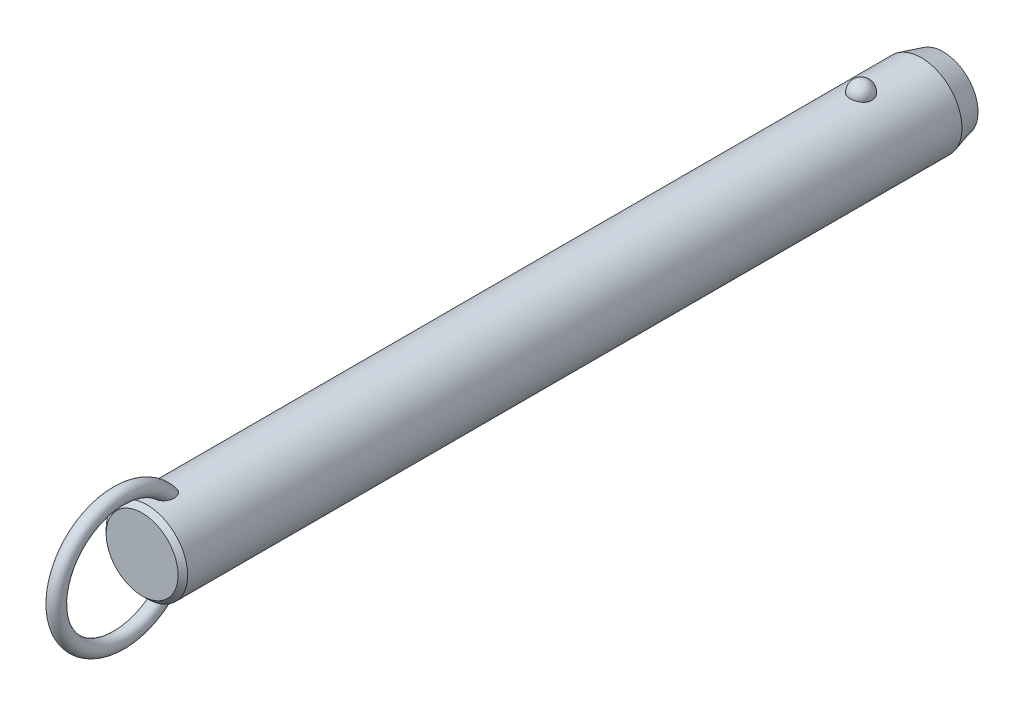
ISO-10303-21;
HEADER;
FILE_DESCRIPTION(('STEP AP214'),'2;1');
FILE_NAME('part.step','',(''),(''),'','','');
FILE_SCHEMA(('AUTOMOTIVE_DESIGN { 1 0 10303 214 1 1 1 1 }'));
ENDSEC;
DATA;
#1=APPLICATION_CONTEXT('core data for automotive mechanical design processes');
#2=APPLICATION_PROTOCOL_DEFINITION('international standard','automotive_design',2000,#1);
#3=PRODUCT_CONTEXT('',#1,'mechanical');
#4=PRODUCT('Part','Part','',(#3));
#5=PRODUCT_RELATED_PRODUCT_CATEGORY('part','',(#4));
#6=PRODUCT_DEFINITION_FORMATION('','',#4);
#7=PRODUCT_DEFINITION_CONTEXT('part definition',#1,'design');
#8=PRODUCT_DEFINITION('design','',#6,#7);
#9=PRODUCT_DEFINITION_SHAPE('','',#8);
#10=(LENGTH_UNIT() NAMED_UNIT(*) SI_UNIT(.MILLI.,.METRE.));
#11=(NAMED_UNIT(*) PLANE_ANGLE_UNIT() SI_UNIT($,.RADIAN.));
#12=(NAMED_UNIT(*) SI_UNIT($,.STERADIAN.) SOLID_ANGLE_UNIT());
#13=UNCERTAINTY_MEASURE_WITH_UNIT(LENGTH_MEASURE(1.E-05),#10,'distance_accuracy_value','');
#14=(GEOMETRIC_REPRESENTATION_CONTEXT(3) GLOBAL_UNCERTAINTY_ASSIGNED_CONTEXT((#13)) GLOBAL_UNIT_ASSIGNED_CONTEXT((#10,
#11,#12)) REPRESENTATION_CONTEXT('',''));
#15=CARTESIAN_POINT('',(0.,0.,0.));
#16=DIRECTION('',(0.,0.,1.));
#17=DIRECTION('',(1.,0.,0.));
#18=AXIS2_PLACEMENT_3D('',#15,#16,#17);
#19=CARTESIAN_POINT('',(0.,0.,180.3));
#20=DIRECTION('',(0.,0.,-1.));
#21=DIRECTION('',(-1.,0.,0.));
#22=AXIS2_PLACEMENT_3D('',#19,#20,#21);
#23=CYLINDRICAL_SURFACE('',#22,11.1);
#24=CARTESIAN_POINT('',(2.9724815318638,10.6945945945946,-3.00000000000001));
#25=CARTESIAN_POINT('',(2.97247830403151,10.6945972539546,-2.8322505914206));
#26=CARTESIAN_POINT('',(2.95876598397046,10.6984356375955,-2.66445972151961));
#27=CARTESIAN_POINT('',(2.90424529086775,10.7133624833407,-2.3336238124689));
#28=CARTESIAN_POINT('',(2.8634252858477,10.7244540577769,-2.17058084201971));
#29=CARTESIAN_POINT('',(2.75573657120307,10.7526272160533,-1.85396767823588));
#30=CARTESIAN_POINT('',(2.68887937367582,10.7697061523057,-1.70039333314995));
#31=CARTESIAN_POINT('',(2.53079696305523,10.8079438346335,-1.4069159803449));
#32=CARTESIAN_POINT('',(2.43957264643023,10.8291024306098,-1.26701246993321));
#33=CARTESIAN_POINT('',(2.23458150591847,10.8732541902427,-1.00409565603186));
#34=CARTESIAN_POINT('',(2.12071295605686,10.8962553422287,-0.881162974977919));
#35=CARTESIAN_POINT('',(1.87365402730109,10.9414421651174,-0.656352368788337));
#36=CARTESIAN_POINT('',(1.74046358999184,10.9636278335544,-0.554474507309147));
#37=CARTESIAN_POINT('',(1.45872188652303,11.0046495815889,-0.374872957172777));
#38=CARTESIAN_POINT('',(1.31021276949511,11.0234944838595,-0.297085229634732));
#39=CARTESIAN_POINT('',(1.00170030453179,11.0557957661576,-0.167529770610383));
#40=CARTESIAN_POINT('',(0.841698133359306,11.0692526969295,-0.1157593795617));
#41=CARTESIAN_POINT('',(0.517607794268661,11.0890932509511,-0.0403925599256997));
#42=CARTESIAN_POINT('',(0.353633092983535,11.0955916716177,-0.0163383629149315));
#43=CARTESIAN_POINT('',(0.0238420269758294,11.1011989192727,0.00445177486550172));
#44=CARTESIAN_POINT('',(-0.141974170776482,11.1003084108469,0.00119017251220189));
#45=CARTESIAN_POINT('',(-0.468405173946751,11.0912990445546,-0.0323233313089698));
#46=CARTESIAN_POINT('',(-0.629059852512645,11.0832767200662,-0.062214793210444));
#47=CARTESIAN_POINT('',(-0.942937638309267,11.0609962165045,-0.147645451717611));
#48=CARTESIAN_POINT('',(-1.09616062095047,11.0467379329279,-0.203185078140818));
#49=CARTESIAN_POINT('',(-1.39181061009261,11.0134071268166,-0.338752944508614));
#50=CARTESIAN_POINT('',(-1.53417383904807,10.9943086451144,-0.418913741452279));
#51=CARTESIAN_POINT('',(-1.80342160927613,10.9533667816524,-0.601448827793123));
#52=CARTESIAN_POINT('',(-1.9303046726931,10.9315231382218,-0.703825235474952));
#53=CARTESIAN_POINT('',(-2.16747598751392,10.887005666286,-0.930091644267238));
#54=CARTESIAN_POINT('',(-2.27742774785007,10.8643239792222,-1.05433291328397));
#55=CARTESIAN_POINT('',(-2.47517316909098,10.8209886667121,-1.31966633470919));
#56=CARTESIAN_POINT('',(-2.56296538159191,10.8003351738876,-1.46075958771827));
#57=CARTESIAN_POINT('',(-2.71500300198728,10.7631304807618,-1.75753646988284));
#58=CARTESIAN_POINT('',(-2.77898901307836,10.7466250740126,-1.91335887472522));
#59=CARTESIAN_POINT('',(-2.88046189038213,10.7198747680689,-2.23391529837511));
#60=CARTESIAN_POINT('',(-2.91794947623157,10.709629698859,-2.3986490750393));
#61=CARTESIAN_POINT('',(-2.96537819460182,10.6965949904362,-2.73165170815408));
#62=CARTESIAN_POINT('',(-2.97542891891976,10.693775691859,-2.89990378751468));
#63=CARTESIAN_POINT('',(-2.96804271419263,10.6958279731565,-3.23575286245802));
#64=CARTESIAN_POINT('',(-2.95060646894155,10.7006993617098,-3.4033498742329));
#65=CARTESIAN_POINT('',(-2.88883358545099,10.71753912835,-3.73233906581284));
#66=CARTESIAN_POINT('',(-2.84462026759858,10.7294749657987,-3.89375610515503));
#67=CARTESIAN_POINT('',(-2.73050447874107,10.7590797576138,-4.20667949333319));
#68=CARTESIAN_POINT('',(-2.66060103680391,10.7767489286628,-4.35818546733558));
#69=CARTESIAN_POINT('',(-2.49642559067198,10.8159599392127,-4.64785421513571));
#70=CARTESIAN_POINT('',(-2.40203047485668,10.8375211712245,-4.78594458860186));
#71=CARTESIAN_POINT('',(-2.19143488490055,10.8820570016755,-5.04410382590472));
#72=CARTESIAN_POINT('',(-2.07523364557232,10.9050316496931,-5.16417205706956));
#73=CARTESIAN_POINT('',(-1.82361254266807,10.9499219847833,-5.3833483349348));
#74=CARTESIAN_POINT('',(-1.68812945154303,10.9718338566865,-5.48238464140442));
#75=CARTESIAN_POINT('',(-1.40191298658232,11.0120611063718,-5.65618873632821));
#76=CARTESIAN_POINT('',(-1.25118062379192,11.0303767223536,-5.73095813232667));
#77=CARTESIAN_POINT('',(-0.940570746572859,11.0611653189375,-5.85334725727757));
#78=CARTESIAN_POINT('',(-0.780821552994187,11.0737044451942,-5.90127578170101));
#79=CARTESIAN_POINT('',(-0.455204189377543,11.0918598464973,-5.96992976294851));
#80=CARTESIAN_POINT('',(-0.289336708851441,11.0974768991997,-5.99065827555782));
#81=CARTESIAN_POINT('',(0.0406846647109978,11.1011307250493,-6.00418773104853));
#82=CARTESIAN_POINT('',(0.204817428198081,11.099299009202,-5.9974731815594));
#83=CARTESIAN_POINT('',(0.5295530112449,11.088551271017,-5.95740317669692));
#84=CARTESIAN_POINT('',(0.69015594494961,11.0796354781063,-5.92404858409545));
#85=CARTESIAN_POINT('',(1.0027760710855,11.0557204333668,-5.83180084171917));
#86=CARTESIAN_POINT('',(1.15482001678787,11.0407414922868,-5.7729929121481));
#87=CARTESIAN_POINT('',(1.44678373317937,11.0062913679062,-5.63147366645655));
#88=CARTESIAN_POINT('',(1.58670279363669,10.9868199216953,-5.54876095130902));
#89=CARTESIAN_POINT('',(1.8527023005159,10.9451315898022,-5.36027644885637));
#90=CARTESIAN_POINT('',(1.97855158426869,10.9228788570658,-5.25418644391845));
#91=CARTESIAN_POINT('',(2.21080872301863,10.8782509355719,-5.02251354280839));
#92=CARTESIAN_POINT('',(2.31721312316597,10.8558757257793,-4.89692718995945));
#93=CARTESIAN_POINT('',(2.5094551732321,10.8130715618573,-4.62745408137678));
#94=CARTESIAN_POINT('',(2.59493284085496,10.7926798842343,-4.48330448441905));
#95=CARTESIAN_POINT('',(2.740862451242,10.7565495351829,-4.18236358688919));
#96=CARTESIAN_POINT('',(2.80132490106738,10.7408089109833,-4.02557762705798));
#97=CARTESIAN_POINT('',(2.88959070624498,10.7173718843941,-3.72475308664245));
#98=CARTESIAN_POINT('',(2.92062102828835,10.7088950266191,-3.58171216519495));
#99=CARTESIAN_POINT('',(2.96206765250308,10.6975052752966,-3.29245795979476));
#100=CARTESIAN_POINT('',(2.97248434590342,10.6945922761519,-3.14624473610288));
#101=CARTESIAN_POINT('',(2.9724815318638,10.6945945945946,-3.00000000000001));
#102=B_SPLINE_CURVE_WITH_KNOTS('',3,(#24,#25,#26,#27,#28,#29,#30,#31,#32,#33,#34,#35,#36,#37,
#38,#39,#40,#41,#42,#43,#44,#45,#46,#47,#48,#49,#50,#51,#52,#53,#54,#55,#56,#57,#58,#59,#60,#61,
#62,#63,#64,#65,#66,#67,#68,#69,#70,#71,#72,#73,#74,#75,#76,#77,#78,#79,#80,#81,#82,#83,#84,#85,
#86,#87,#88,#89,#90,#91,#92,#93,#94,#95,#96,#97,#98,#99,#100,#101),.UNSPECIFIED.,.T.,.F.,(4,2,2,
2,2,2,2,2,2,2,2,2,2,2,2,2,2,2,2,2,2,2,2,2,2,2,2,2,2,2,2,2,2,2,2,2,2,2,4),(0.,0.502722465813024,
1.00566079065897,1.5083769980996,2.01107471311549,2.51608392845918,3.02109467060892,
3.52475118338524,4.02835620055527,4.523518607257,5.0186364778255,5.50715297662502,
5.9956776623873,6.48688002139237,6.97812923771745,7.47814366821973,7.9781907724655,
8.48353712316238,8.9888697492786,9.49218093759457,9.99547960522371,10.4964777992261,
10.997494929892,11.5010810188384,12.0046847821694,12.5099796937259,13.0152411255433,
13.5145635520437,14.0138298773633,14.5043200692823,14.9947943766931,15.4836390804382,
15.9725123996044,16.4685040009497,16.9645836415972,17.4686765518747,17.972557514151,
18.410841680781,18.849117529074),.UNSPECIFIED.);
#103=CARTESIAN_POINT('',(2.9724815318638,10.6945945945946,-3.00000000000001));
#104=VERTEX_POINT('',#103);
#105=EDGE_CURVE('E41',#104,#104,#102,.T.);
#106=ORIENTED_EDGE('',*,*,#105,.T.);
#107=EDGE_LOOP('',(#106));
#108=FACE_BOUND('',#107,.T.);
#109=CARTESIAN_POINT('',(0.,0.,191.7));
#110=DIRECTION('',(0.,0.,1.));
#111=DIRECTION('',(1.,0.,0.));
#112=AXIS2_PLACEMENT_3D('',#109,#110,#111);
#113=CIRCLE('',#112,11.1);
#114=CARTESIAN_POINT('',(11.1,0.,191.7));
#115=VERTEX_POINT('',#114);
#116=EDGE_CURVE('E10',#115,#115,#113,.F.);
#117=ORIENTED_EDGE('',*,*,#116,.T.);
#118=EDGE_LOOP('',(#117));
#119=FACE_BOUND('',#118,.T.);
#120=CARTESIAN_POINT('',(-0.564520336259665,-11.0856356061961,183.957815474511));
#121=CARTESIAN_POINT('',(-0.667202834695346,-11.0804062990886,183.991283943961));
#122=CARTESIAN_POINT('',(-0.766875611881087,-11.0738877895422,184.033835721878));
#123=CARTESIAN_POINT('',(-0.95728412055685,-11.0590576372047,184.135419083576));
#124=CARTESIAN_POINT('',(-1.04801616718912,-11.0507452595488,184.19445742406));
#125=CARTESIAN_POINT('',(-1.21800952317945,-11.0333016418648,184.326529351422));
#126=CARTESIAN_POINT('',(-1.2973080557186,-11.0241732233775,184.399515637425));
#127=CARTESIAN_POINT('',(-1.44337665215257,-11.0060026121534,184.557037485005));
#128=CARTESIAN_POINT('',(-1.51014622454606,-10.9969604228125,184.641573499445));
#129=CARTESIAN_POINT('',(-1.63454620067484,-10.9791841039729,184.825521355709));
#130=CARTESIAN_POINT('',(-1.69127003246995,-10.9705107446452,184.925549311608));
#131=CARTESIAN_POINT('',(-1.7898078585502,-10.9548648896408,185.132790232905));
#132=CARTESIAN_POINT('',(-1.83161214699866,-10.9478935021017,185.240007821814));
#133=CARTESIAN_POINT('',(-1.91557028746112,-10.9335803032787,185.505408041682));
#134=CARTESIAN_POINT('',(-1.95040620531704,-10.9273269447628,185.665980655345));
#135=CARTESIAN_POINT('',(-1.99388326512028,-10.9194709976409,185.990697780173));
#136=CARTESIAN_POINT('',(-2.00248051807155,-10.9178762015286,186.154847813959));
#137=CARTESIAN_POINT('',(-1.99551615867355,-10.9191578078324,186.524650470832));
#138=CARTESIAN_POINT('',(-1.97322066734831,-10.9232807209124,186.730191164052));
#139=CARTESIAN_POINT('',(-1.91529761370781,-10.9335244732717,187.033595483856));
#140=CARTESIAN_POINT('',(-1.89184575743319,-10.9376266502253,187.134088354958));
#141=CARTESIAN_POINT('',(-1.83700674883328,-10.9469720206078,187.332855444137));
#142=CARTESIAN_POINT('',(-1.80562070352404,-10.9522150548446,187.431129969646));
#143=CARTESIAN_POINT('',(-1.73463055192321,-10.9636837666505,187.625914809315));
#144=CARTESIAN_POINT('',(-1.69493416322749,-10.9699202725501,187.722390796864));
#145=CARTESIAN_POINT('',(-1.60745141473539,-10.9830806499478,187.911626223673));
#146=CARTESIAN_POINT('',(-1.55966150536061,-10.9900048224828,188.004384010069));
#147=CARTESIAN_POINT('',(-1.45591812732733,-11.0042280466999,188.184690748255));
#148=CARTESIAN_POINT('',(-1.40000013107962,-11.0115253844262,188.272260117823));
#149=CARTESIAN_POINT('',(-1.27937470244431,-11.0261911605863,188.441029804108));
#150=CARTESIAN_POINT('',(-1.21467835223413,-11.0335594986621,188.52223795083));
#151=CARTESIAN_POINT('',(-1.08218150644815,-11.0473027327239,188.669001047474));
#152=CARTESIAN_POINT('',(-1.01522633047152,-11.0537063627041,188.735309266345));
#153=CARTESIAN_POINT('',(-0.872952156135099,-11.065850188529,188.858378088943));
#154=CARTESIAN_POINT('',(-0.797642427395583,-11.0715911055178,188.915149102));
#155=CARTESIAN_POINT('',(-0.651396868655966,-11.081071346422,189.007515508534));
#156=CARTESIAN_POINT('',(-0.581712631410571,-11.0849841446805,189.045049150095));
#157=CARTESIAN_POINT('',(-0.437066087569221,-11.0916271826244,189.108259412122));
#158=CARTESIAN_POINT('',(-0.362109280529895,-11.0943586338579,189.133948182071));
#159=CARTESIAN_POINT('',(-0.207828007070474,-11.0983242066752,189.171117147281));
#160=CARTESIAN_POINT('',(-0.12846771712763,-11.0995432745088,189.182454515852));
#161=CARTESIAN_POINT('',(0.0309101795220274,-11.1002423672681,189.188965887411));
#162=CARTESIAN_POINT('',(0.110927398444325,-11.0997233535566,189.184148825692));
#163=CARTESIAN_POINT('',(0.256406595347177,-11.097240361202,189.160959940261));
#164=CARTESIAN_POINT('',(0.322235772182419,-11.0955074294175,189.144754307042));
#165=CARTESIAN_POINT('',(0.450635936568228,-11.0910350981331,189.102600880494));
#166=CARTESIAN_POINT('',(0.513205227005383,-11.0882951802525,189.076648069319));
#167=CARTESIAN_POINT('',(0.662626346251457,-11.0805620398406,189.002607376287));
#168=CARTESIAN_POINT('',(0.747127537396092,-11.0751144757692,188.949845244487));
#169=CARTESIAN_POINT('',(0.906756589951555,-11.0631932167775,188.831720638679));
#170=CARTESIAN_POINT('',(0.981859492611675,-11.0567168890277,188.766325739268));
#171=CARTESIAN_POINT('',(1.10712207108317,-11.0447856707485,188.64226337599));
#172=CARTESIAN_POINT('',(1.15909566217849,-11.0394280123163,188.585383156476));
#173=CARTESIAN_POINT('',(1.2579192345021,-11.0286040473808,188.467327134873));
#174=CARTESIAN_POINT('',(1.30476642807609,-11.0231376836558,188.406149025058));
#175=CARTESIAN_POINT('',(1.43818612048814,-11.0068027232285,188.217305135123));
#176=CARTESIAN_POINT('',(1.51751767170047,-10.9960104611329,188.084453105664));
#177=CARTESIAN_POINT('',(1.63597546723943,-10.9788847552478,187.853137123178));
#178=CARTESIAN_POINT('',(1.67988876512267,-10.9722190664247,187.757053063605));
#179=CARTESIAN_POINT('',(1.75953241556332,-10.9597298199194,187.561431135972));
#180=CARTESIAN_POINT('',(1.7952596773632,-10.9539065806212,187.461891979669));
#181=CARTESIAN_POINT('',(1.85844731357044,-10.9433632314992,187.26021118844));
#182=CARTESIAN_POINT('',(1.8859107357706,-10.9386427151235,187.15807052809));
#183=CARTESIAN_POINT('',(1.93234324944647,-10.9305350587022,186.951819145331));
#184=CARTESIAN_POINT('',(1.95131065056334,-10.9271481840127,186.847708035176));
#185=CARTESIAN_POINT('',(1.99040203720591,-10.9201183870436,186.565458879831));
#186=CARTESIAN_POINT('',(2.00221217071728,-10.9179256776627,186.386037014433));
#187=CARTESIAN_POINT('',(1.99711676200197,-10.9188636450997,186.027713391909));
#188=CARTESIAN_POINT('',(1.98026150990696,-10.9219849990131,185.848811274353));
#189=CARTESIAN_POINT('',(1.92151657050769,-10.9324473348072,185.53645144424));
#190=CARTESIAN_POINT('',(1.88605081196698,-10.9386915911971,185.401759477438));
#191=CARTESIAN_POINT('',(1.79393020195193,-10.9541780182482,185.139966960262));
#192=CARTESIAN_POINT('',(1.73729868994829,-10.9634168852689,185.012858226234));
#193=CARTESIAN_POINT('',(1.61237037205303,-10.9824218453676,184.789418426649));
#194=CARTESIAN_POINT('',(1.54715374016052,-10.9918945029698,184.691345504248));
#195=CARTESIAN_POINT('',(1.40127026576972,-11.0114415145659,184.507434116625));
#196=CARTESIAN_POINT('',(1.32060742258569,-11.0215157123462,184.421592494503));
#197=CARTESIAN_POINT('',(1.1447478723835,-11.041168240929,184.265163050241));
#198=CARTESIAN_POINT('',(1.04947805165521,-11.0507437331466,184.194656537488));
#199=CARTESIAN_POINT('',(0.847278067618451,-11.0680789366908,184.072640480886));
#200=CARTESIAN_POINT('',(0.740351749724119,-11.0758392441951,184.021124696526));
#201=CARTESIAN_POINT('',(0.529289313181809,-11.0878275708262,183.943485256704));
#202=CARTESIAN_POINT('',(0.425895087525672,-11.0923259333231,183.915377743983));
#203=CARTESIAN_POINT('',(0.215723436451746,-11.0984001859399,183.877703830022));
#204=CARTESIAN_POINT('',(0.10894793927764,-11.0999777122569,183.868127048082));
#205=CARTESIAN_POINT('',(-0.0938962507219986,-11.1000196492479,183.867877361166));
#206=CARTESIAN_POINT('',(-0.189967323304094,-11.0987797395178,183.875408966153));
#207=CARTESIAN_POINT('',(-0.379657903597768,-11.0939111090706,183.905507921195));
#208=CARTESIAN_POINT('',(-0.47327735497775,-11.0902823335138,183.928075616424));
#209=CARTESIAN_POINT('',(-0.564520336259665,-11.0856356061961,183.957815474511));
#210=B_SPLINE_CURVE_WITH_KNOTS('',3,(#120,#121,#122,#123,#124,#125,#126,#127,#128,#129,#130,
#131,#132,#133,#134,#135,#136,#137,#138,#139,#140,#141,#142,#143,#144,#145,#146,#147,#148,#149,
#150,#151,#152,#153,#154,#155,#156,#157,#158,#159,#160,#161,#162,#163,#164,#165,#166,#167,#168,
#169,#170,#171,#172,#173,#174,#175,#176,#177,#178,#179,#180,#181,#182,#183,#184,#185,#186,#187,
#188,#189,#190,#191,#192,#193,#194,#195,#196,#197,#198,#199,#200,#201,#202,#203,#204,#205,#206,
#207,#208,#209),.UNSPECIFIED.,.T.,.F.,(4,2,2,2,2,2,2,2,2,2,2,2,2,2,2,2,2,2,2,2,2,2,2,2,2,2,2,2,
2,2,2,2,2,2,2,2,2,2,2,2,2,2,2,2,4),(0.,0.323999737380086,0.64813245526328,0.971184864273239,
1.29424994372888,1.63886237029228,1.98369857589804,2.47426059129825,2.96564271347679,
3.58257396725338,3.89215258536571,4.20168803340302,4.51486273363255,4.82817514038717,
5.14015911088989,5.45175282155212,5.73442856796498,6.01679375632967,6.2536458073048,
6.49025437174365,6.72919963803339,6.96801276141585,7.17061258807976,7.37331685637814,
7.67094989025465,7.96935728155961,8.20075067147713,8.43226927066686,8.89581623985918,
9.21306533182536,9.53043400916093,9.84768549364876,10.1650000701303,10.7022930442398,
11.2386443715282,11.655339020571,12.071575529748,12.4245637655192,12.7774607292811,
13.1321855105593,13.4867936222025,13.8068771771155,14.1267813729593,14.4146787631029,
14.7025827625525),.UNSPECIFIED.);
#211=CARTESIAN_POINT('',(-0.564520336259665,-11.0856356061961,183.957815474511));
#212=VERTEX_POINT('',#211);
#213=EDGE_CURVE('E59',#212,#212,#210,.T.);
#214=ORIENTED_EDGE('',*,*,#213,.T.);
#215=EDGE_LOOP('',(#214));
#216=FACE_BOUND('',#215,.T.);
#217=CARTESIAN_POINT('',(-0.564520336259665,11.0856356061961,183.957815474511));
#218=CARTESIAN_POINT('',(-0.468542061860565,11.0905203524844,183.926545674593));
#219=CARTESIAN_POINT('',(-0.369793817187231,11.0942886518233,183.903157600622));
#220=CARTESIAN_POINT('',(-0.169555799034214,11.0991586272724,183.873085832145));
#221=CARTESIAN_POINT('',(-0.0680604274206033,11.1002543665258,183.86643932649));
#222=CARTESIAN_POINT('',(0.134549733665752,11.099646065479,183.870157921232));
#223=CARTESIAN_POINT('',(0.235664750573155,11.0979441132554,183.88051033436));
#224=CARTESIAN_POINT('',(0.434632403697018,11.0919342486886,183.917831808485));
#225=CARTESIAN_POINT('',(0.532486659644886,11.0876276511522,183.944792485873));
#226=CARTESIAN_POINT('',(0.722445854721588,11.0768742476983,184.0144096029));
#227=CARTESIAN_POINT('',(0.814543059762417,11.0704246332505,184.057086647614));
#228=CARTESIAN_POINT('',(0.990565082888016,11.0560659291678,184.156648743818));
#229=CARTESIAN_POINT('',(1.07448844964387,11.048156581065,184.213536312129));
#230=CARTESIAN_POINT('',(1.23562672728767,11.0313221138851,184.342210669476));
#231=CARTESIAN_POINT('',(1.3124268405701,11.0223686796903,184.414511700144));
#232=CARTESIAN_POINT('',(1.45398030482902,11.0045918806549,184.570042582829));
#233=CARTESIAN_POINT('',(1.51873073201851,10.9957685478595,184.653275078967));
#234=CARTESIAN_POINT('',(1.64107232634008,10.9782087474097,184.836384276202));
#235=CARTESIAN_POINT('',(1.6974317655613,10.9695572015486,184.937089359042));
#236=CARTESIAN_POINT('',(1.79515063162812,10.9539887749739,185.145626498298));
#237=CARTESIAN_POINT('',(1.83649966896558,10.9470730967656,185.25346343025));
#238=CARTESIAN_POINT('',(1.91931148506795,10.9329211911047,185.520399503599));
#239=CARTESIAN_POINT('',(1.95340104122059,10.9267904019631,185.681861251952));
#240=CARTESIAN_POINT('',(1.99526195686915,10.9192174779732,186.00821631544));
#241=CARTESIAN_POINT('',(2.00298989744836,10.9177830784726,186.17311484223));
#242=CARTESIAN_POINT('',(1.99396251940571,10.9194420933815,186.544100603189));
#243=CARTESIAN_POINT('',(1.97050829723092,10.923774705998,186.75003871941));
#244=CARTESIAN_POINT('',(1.91079643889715,10.9343131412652,187.053901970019));
#245=CARTESIAN_POINT('',(1.88673702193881,10.9385106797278,187.154529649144));
#246=CARTESIAN_POINT('',(1.8306550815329,10.9480376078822,187.353510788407));
#247=CARTESIAN_POINT('',(1.79863369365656,10.9533668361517,187.451864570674));
#248=CARTESIAN_POINT('',(1.72633365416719,10.9649954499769,187.646720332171));
#249=CARTESIAN_POINT('',(1.68596409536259,10.9713053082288,187.74318790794));
#250=CARTESIAN_POINT('',(1.59707998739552,10.9845964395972,187.932323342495));
#251=CARTESIAN_POINT('',(1.54856169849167,10.9915780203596,188.024989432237));
#252=CARTESIAN_POINT('',(1.44330168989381,11.0058935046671,188.204975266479));
#253=CARTESIAN_POINT('',(1.3865974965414,11.0132257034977,188.292316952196));
#254=CARTESIAN_POINT('',(1.26431158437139,11.0279330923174,188.460456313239));
#255=CARTESIAN_POINT('',(1.19874160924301,11.0353082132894,188.541262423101));
#256=CARTESIAN_POINT('',(1.06542088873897,11.048931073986,188.685985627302));
#257=CARTESIAN_POINT('',(0.998640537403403,11.0552153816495,188.750784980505));
#258=CARTESIAN_POINT('',(0.856896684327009,11.0671032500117,188.870846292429));
#259=CARTESIAN_POINT('',(0.781942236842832,11.0727075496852,188.926118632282));
#260=CARTESIAN_POINT('',(0.636276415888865,11.081949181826,189.015972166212));
#261=CARTESIAN_POINT('',(0.566755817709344,11.0857572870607,189.052441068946));
#262=CARTESIAN_POINT('',(0.422602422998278,11.0921860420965,189.113533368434));
#263=CARTESIAN_POINT('',(0.347974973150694,11.0948079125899,189.138168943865));
#264=CARTESIAN_POINT('',(0.194593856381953,11.0985608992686,189.173323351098));
#265=CARTESIAN_POINT('',(0.115807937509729,11.0996777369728,189.183706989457));
#266=CARTESIAN_POINT('',(-0.0422499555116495,11.1002003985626,189.188574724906));
#267=CARTESIAN_POINT('',(-0.121521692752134,11.09960699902,189.183066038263));
#268=CARTESIAN_POINT('',(-0.26604624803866,11.0970123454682,189.158827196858));
#269=CARTESIAN_POINT('',(-0.331661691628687,11.0952283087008,189.142135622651));
#270=CARTESIAN_POINT('',(-0.459588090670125,11.0906663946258,189.099111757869));
#271=CARTESIAN_POINT('',(-0.521897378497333,11.0878880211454,189.072774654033));
#272=CARTESIAN_POINT('',(-0.671446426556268,11.0800342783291,188.997513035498));
#273=CARTESIAN_POINT('',(-0.756250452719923,11.0744969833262,188.943818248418));
#274=CARTESIAN_POINT('',(-0.916349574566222,11.0624045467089,188.823802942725));
#275=CARTESIAN_POINT('',(-0.991618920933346,11.0558467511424,188.757449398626));
#276=CARTESIAN_POINT('',(-1.11713140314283,11.0437783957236,188.631633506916));
#277=CARTESIAN_POINT('',(-1.16920539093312,11.0383619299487,188.573952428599));
#278=CARTESIAN_POINT('',(-1.26817476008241,11.02743010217,188.454280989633));
#279=CARTESIAN_POINT('',(-1.31506731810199,11.0219146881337,188.392288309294));
#280=CARTESIAN_POINT('',(-1.40399813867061,11.0109399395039,188.264784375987));
#281=CARTESIAN_POINT('',(-1.44602864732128,11.0054807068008,188.199267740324));
#282=CARTESIAN_POINT('',(-1.52538779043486,10.9947621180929,188.065422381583));
#283=CARTESIAN_POINT('',(-1.56271516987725,10.9895028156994,187.997092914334));
#284=CARTESIAN_POINT('',(-1.64537943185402,10.9774790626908,187.833210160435));
#285=CARTESIAN_POINT('',(-1.68879497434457,10.9708503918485,187.7366735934));
#286=CARTESIAN_POINT('',(-1.76740738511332,10.9584602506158,187.540236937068));
#287=CARTESIAN_POINT('',(-1.80260120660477,10.95269910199,187.44033561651));
#288=CARTESIAN_POINT('',(-1.86468657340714,10.9423003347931,187.237966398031));
#289=CARTESIAN_POINT('',(-1.8915816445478,10.9376622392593,187.135499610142));
#290=CARTESIAN_POINT('',(-1.93682458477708,10.9297405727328,186.928642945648));
#291=CARTESIAN_POINT('',(-1.95517082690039,10.9264572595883,186.824252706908));
#292=CARTESIAN_POINT('',(-1.99232562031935,10.9197647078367,186.54262876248));
#293=CARTESIAN_POINT('',(-2.00294603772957,10.9177914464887,186.364185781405));
#294=CARTESIAN_POINT('',(-1.99566675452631,10.9191290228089,186.007996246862));
#295=CARTESIAN_POINT('',(-1.97781651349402,10.9224306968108,185.83024902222));
#296=CARTESIAN_POINT('',(-1.91747214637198,10.9331592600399,185.519792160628));
#297=CARTESIAN_POINT('',(-1.88131022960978,10.9395108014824,185.385825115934));
#298=CARTESIAN_POINT('',(-1.78790380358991,10.9551659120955,185.12559757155));
#299=CARTESIAN_POINT('',(-1.73068309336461,10.9644661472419,184.999328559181));
#300=CARTESIAN_POINT('',(-1.60475573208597,10.9835398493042,184.77741565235));
#301=CARTESIAN_POINT('',(-1.53908879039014,10.9930297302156,184.680026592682));
#302=CARTESIAN_POINT('',(-1.39238608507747,11.0125708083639,184.497525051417));
#303=CARTESIAN_POINT('',(-1.31135150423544,11.0226219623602,184.412411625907));
#304=CARTESIAN_POINT('',(-1.14382035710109,11.0411991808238,184.26529943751));
#305=CARTESIAN_POINT('',(-1.0585850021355,11.0497792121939,184.20186930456));
#306=CARTESIAN_POINT('',(-0.878723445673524,11.0655285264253,184.090250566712));
#307=CARTESIAN_POINT('',(-0.784123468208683,11.0727015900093,184.042020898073));
#308=CARTESIAN_POINT('',(-0.646163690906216,11.0812501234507,183.986023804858));
#309=CARTESIAN_POINT('',(-0.605595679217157,11.0835451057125,183.971197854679));
#310=CARTESIAN_POINT('',(-0.564520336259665,11.0856356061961,183.957815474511));
#311=B_SPLINE_CURVE_WITH_KNOTS('',3,(#217,#218,#219,#220,#221,#222,#223,#224,#225,#226,#227,
#228,#229,#230,#231,#232,#233,#234,#235,#236,#237,#238,#239,#240,#241,#242,#243,#244,#245,#246,
#247,#248,#249,#250,#251,#252,#253,#254,#255,#256,#257,#258,#259,#260,#261,#262,#263,#264,#265,
#266,#267,#268,#269,#270,#271,#272,#273,#274,#275,#276,#277,#278,#279,#280,#281,#282,#283,#284,
#285,#286,#287,#288,#289,#290,#291,#292,#293,#294,#295,#296,#297,#298,#299,#300,#301,#302,#303,
#304,#305,#306,#307,#308,#309,#310),.UNSPECIFIED.,.T.,.F.,(4,2,2,2,2,2,2,2,2,2,2,2,2,2,2,2,2,2,
2,2,2,2,2,2,2,2,2,2,2,2,2,2,2,2,2,2,2,2,2,2,2,2,2,2,2,2,4),(0.,0.303061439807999,
0.606795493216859,0.910302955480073,1.21365733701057,1.51741085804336,1.82121821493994,
2.13745205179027,2.45376252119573,2.79958678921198,3.14564996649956,3.63832391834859,
4.13180893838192,4.75031912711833,5.06071926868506,5.37107516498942,5.6850077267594,
5.99908475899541,6.31176519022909,6.62403542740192,6.90315673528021,7.18197194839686,
7.41687778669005,7.65154134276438,7.88841587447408,8.12518286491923,8.32752842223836,
8.52997509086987,8.82986421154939,9.13054668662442,9.36393502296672,9.59744991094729,
9.83133221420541,10.0652767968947,10.383032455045,10.7009056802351,11.0186436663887,
11.3364420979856,11.8705925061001,12.4038159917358,12.8189662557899,13.2336487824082,
13.5857049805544,13.9377340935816,14.2561354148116,14.5736690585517,14.7033687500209),.UNSPECIFIED.);
#312=CARTESIAN_POINT('',(-0.564520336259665,11.0856356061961,183.957815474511));
#313=VERTEX_POINT('',#312);
#314=EDGE_CURVE('E66',#313,#313,#311,.T.);
#315=ORIENTED_EDGE('',*,*,#314,.T.);
#316=EDGE_LOOP('',(#315));
#317=FACE_BOUND('',#316,.T.);
#318=CARTESIAN_POINT('',(0.,0.,-19.3999999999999));
#319=DIRECTION('',(0.,0.,-1.));
#320=DIRECTION('',(-1.,0.,0.));
#321=AXIS2_PLACEMENT_3D('',#318,#319,#320);
#322=CIRCLE('',#321,11.1);
#323=CARTESIAN_POINT('',(-11.1,0.,-19.3999999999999));
#324=VERTEX_POINT('',#323);
#325=EDGE_CURVE('E56',#324,#324,#322,.F.);
#326=ORIENTED_EDGE('',*,*,#325,.T.);
#327=EDGE_LOOP('',(#326));
#328=FACE_BOUND('',#327,.T.);
#329=ADVANCED_FACE('F37',(#108,#119,#216,#317,#328),#23,.T.);
#330=CARTESIAN_POINT('',(0.,0.,-25.4));
#331=DIRECTION('',(0.,0.,-1.));
#332=DIRECTION('',(-1.,0.,0.));
#333=AXIS2_PLACEMENT_3D('',#330,#331,#332);
#334=PLANE('',#333);
#335=CARTESIAN_POINT('',(0.,0.,-25.4));
#336=DIRECTION('',(0.,0.,-1.));
#337=DIRECTION('',(-1.,0.,0.));
#338=AXIS2_PLACEMENT_3D('',#335,#336,#337);
#339=CIRCLE('',#338,9.49230484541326);
#340=CARTESIAN_POINT('',(-9.49230484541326,0.,-25.4));
#341=VERTEX_POINT('',#340);
#342=EDGE_CURVE('E65',#341,#341,#339,.T.);
#343=ORIENTED_EDGE('',*,*,#342,.T.);
#344=EDGE_LOOP('',(#343));
#345=FACE_BOUND('',#344,.T.);
#346=ADVANCED_FACE('F84',(#345),#334,.T.);
#347=CARTESIAN_POINT('',(0.,0.,-25.4));
#348=DIRECTION('',(0.,0.,1.));
#349=DIRECTION('',(1.,0.,0.));
#350=AXIS2_PLACEMENT_3D('',#347,#348,#349);
#351=CONICAL_SURFACE('',#350,9.49230484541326,0.261799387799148);
#352=ORIENTED_EDGE('',*,*,#325,.F.);
#353=EDGE_LOOP('',(#352));
#354=FACE_BOUND('',#353,.T.);
#355=ORIENTED_EDGE('',*,*,#342,.F.);
#356=EDGE_LOOP('',(#355));
#357=FACE_BOUND('',#356,.T.);
#358=ADVANCED_FACE('F82',(#354,#357),#351,.T.);
#359=CARTESIAN_POINT('',(0.,0.,193.));
#360=DIRECTION('',(0.,0.,1.));
#361=DIRECTION('',(1.,0.,0.));
#362=AXIS2_PLACEMENT_3D('',#359,#360,#361);
#363=PLANE('',#362);
#364=CARTESIAN_POINT('',(0.,0.,193.));
#365=DIRECTION('',(0.,0.,1.));
#366=DIRECTION('',(1.,0.,0.));
#367=AXIS2_PLACEMENT_3D('',#364,#365,#366);
#368=CIRCLE('',#367,9.79999999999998);
#369=CARTESIAN_POINT('',(9.79999999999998,0.,193.));
#370=VERTEX_POINT('',#369);
#371=EDGE_CURVE('E50',#370,#370,#368,.T.);
#372=ORIENTED_EDGE('',*,*,#371,.T.);
#373=EDGE_LOOP('',(#372));
#374=FACE_BOUND('',#373,.T.);
#375=ADVANCED_FACE('F76',(#374),#363,.T.);
#376=CARTESIAN_POINT('',(0.,0.,199.35));
#377=DIRECTION('',(1.,0.,0.));
#378=DIRECTION('',(0.,0.,-1.));
#379=AXIS2_PLACEMENT_3D('',#376,#377,#378);
#380=TOROIDAL_SURFACE('',#379,17.05,2.);
#381=ORIENTED_EDGE('',*,*,#314,.F.);
#382=EDGE_LOOP('',(#381));
#383=FACE_BOUND('',#382,.T.);
#384=ORIENTED_EDGE('',*,*,#213,.F.);
#385=EDGE_LOOP('',(#384));
#386=FACE_BOUND('',#385,.T.);
#387=ADVANCED_FACE('F72',(#383,#386),#380,.T.);
#388=CARTESIAN_POINT('',(0.,0.,193.));
#389=DIRECTION('',(0.,0.,-1.));
#390=DIRECTION('',(-1.,0.,0.));
#391=AXIS2_PLACEMENT_3D('',#388,#389,#390);
#392=CONICAL_SURFACE('',#391,9.79999999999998,0.785398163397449);
#393=ORIENTED_EDGE('',*,*,#116,.F.);
#394=EDGE_LOOP('',(#393));
#395=FACE_BOUND('',#394,.T.);
#396=ORIENTED_EDGE('',*,*,#371,.F.);
#397=EDGE_LOOP('',(#396));
#398=FACE_BOUND('',#397,.T.);
#399=ADVANCED_FACE('F39',(#395,#398),#392,.T.);
#400=CARTESIAN_POINT('',(0.,11.1,-3.00000000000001));
#401=DIRECTION('',(0.,1.,0.));
#402=DIRECTION('',(0.,0.,-1.));
#403=AXIS2_PLACEMENT_3D('',#400,#401,#402);
#404=SPHERICAL_SURFACE('',#403,3.);
#405=ORIENTED_EDGE('',*,*,#105,.F.);
#406=EDGE_LOOP('',(#405));
#407=FACE_BOUND('',#406,.T.);
#408=ADVANCED_FACE('F78',(#407),#404,.T.);
#409=CLOSED_SHELL('',(#329,#346,#358,#375,#387,#399,#408));
#410=MANIFOLD_SOLID_BREP('B2',#409);
#411=ADVANCED_BREP_SHAPE_REPRESENTATION('',(#18,#410),#14);
#412=SHAPE_DEFINITION_REPRESENTATION(#9,#411);
ENDSEC;
END-ISO-10303-21;
